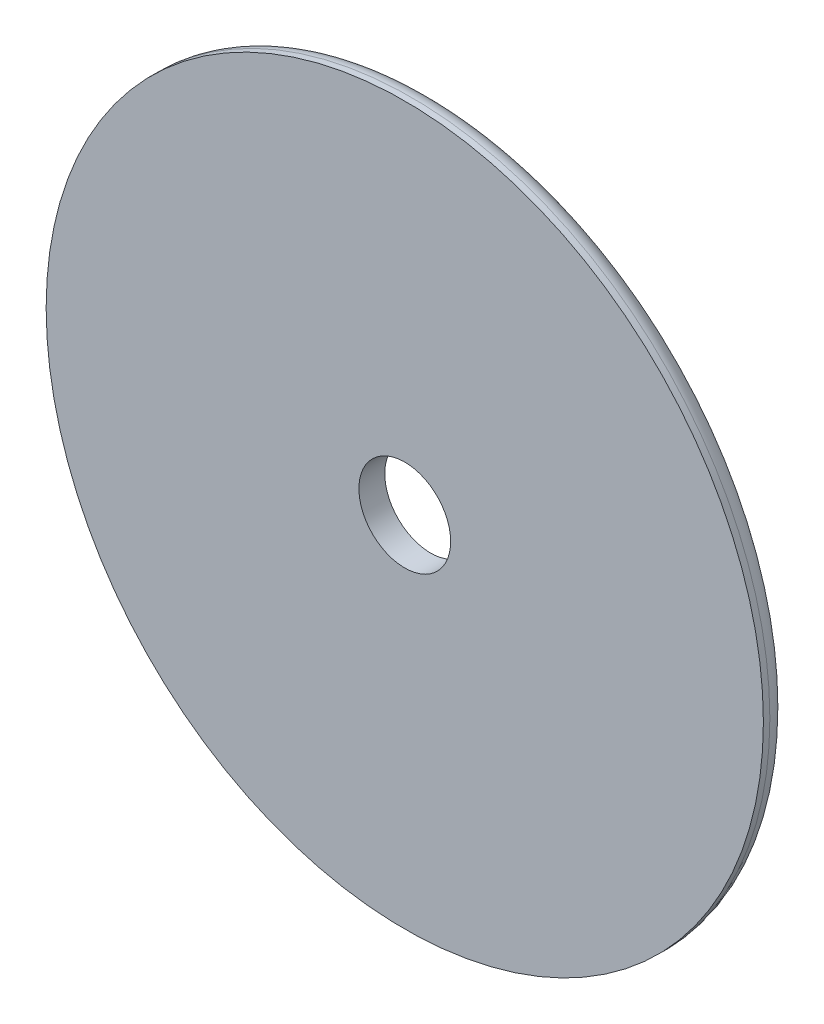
from build123d import *

# Parameters (mm, degrees)
ESQUISSE1_R          = 55.5
ESQUISSE1_R_2        = 7.1
BASE_EXTRUSION_DEPTH = 4
CONG_1_R             = 3


with BuildPart() as part:
    # Esquisse1 → Base-Extrusion (new body)
    with BuildSketch(Plane.XY):
        Circle(ESQUISSE1_R)
        Circle(ESQUISSE1_R_2, mode=Mode.SUBTRACT)
    extrude(amount=BASE_EXTRUSION_DEPTH)

    # Cong_1
    cong_1_edges = [part.edges().sort_by_distance(p)[0] for p in [
        (-55.5, 0, 0),
    ]]
    fillet(cong_1_edges, radius=CONG_1_R)


solid = part.part
